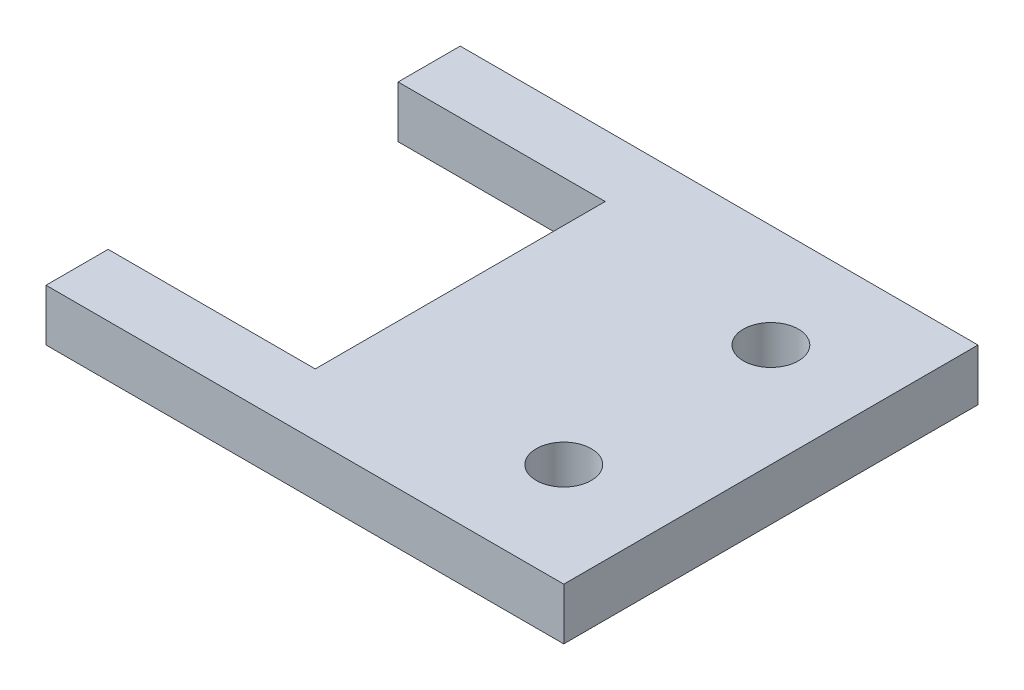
from build123d import *

# Parameters (mm, degrees)
SKETCH1_W                = 63.5
SKETCH1_H                = 50.8
BOSS_EXTRUDE1_DEPTH      = 6.35
SKETCH2_W                = 25.4
SKETCH2_H                = 35.56
CUT_EXTRUDE1_DEPTH       = 6.35
H_0_266_DIAMETER_HOLE1_D = 6.7564


with BuildPart() as part:
    # Sketch1 → Boss-Extrude1 (new body)
    with BuildSketch(Plane(origin=(0, 0, 0), x_dir=(1, 0, 0), z_dir=(0, 1, 0))):
        with Locations((-22.800429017, -0.353499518)):
            Rectangle(SKETCH1_W, SKETCH1_H)
    extrude(amount=BOSS_EXTRUDE1_DEPTH)

    # Sketch2 → Cut-Extrude1 (cut)
    with BuildSketch(Plane(origin=(0, 6.35, 0), x_dir=(1, 0, 0), z_dir=(0, 1, 0))):
        with Locations((-41.850429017, -0.353499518)):
            Rectangle(SKETCH2_W, SKETCH2_H)
    extrude(amount=-CUT_EXTRUDE1_DEPTH, mode=Mode.SUBTRACT)

    # H _0.266_ Diameter Hole1 (through all)
    with Locations(Plane(origin=(0, 6.35, 0), x_dir=(1, 0, 0), z_dir=(0, 1, 0))):
        with Locations((-3.750429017, 12.346500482), (-3.750429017, -13.053499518)):
            Hole(H_0_266_DIAMETER_HOLE1_D / 2)


solid = part.part
